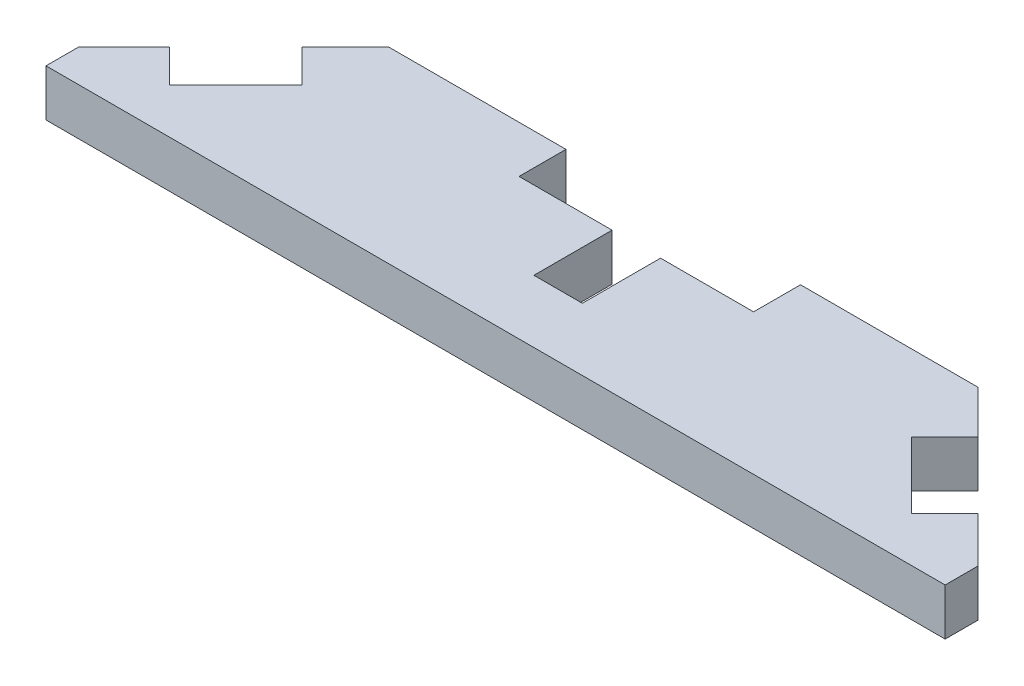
from build123d import *

# Parameters (mm, degrees)
BOSS_EXTRUDE1_DEPTH = 3
SKETCH2_W           = 15
SKETCH2_H           = 3
CUT_EXTRUDE1_DEPTH  = 3
SKETCH3_W           = 3.1
SKETCH3_H           = 8
CUT_EXTRUDE2_DEPTH  = 10
SKETCH4_W           = 1.2
SKETCH4_H           = 18.592899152
CUT_EXTRUDE3_DEPTH  = 31.692059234


with BuildPart() as part:
    # Sketch1 → Boss-Extrude1 (new body)
    with BuildSketch(Plane(origin=(0, 0, 0), x_dir=(1, 0, 0), z_dir=(0, 1, 0))):
        Polygon((-18.85, 6), (-29.95, -5.1), (-29.95, -6), (-18.85, -6), (18.85, -6), (29.95, -6), (29.95, -5.1), (18.85, 6), align=None)
    extrude(amount=BOSS_EXTRUDE1_DEPTH)

    # Sketch2 → Cut-Extrude1 (cut)
    with BuildSketch(Plane(origin=(0, 0, 0), x_dir=(1, 0, 0), z_dir=(0, 1, 0))):
        Polygon((-25.850357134, -1.000357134), (-21.607716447, 3.242283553), (-19.486396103, 1.12096321), (-23.72903679, -3.121677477), align=None)
        Polygon((23.72903679, -3.121677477), (19.486396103, 1.12096321), (21.607716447, 3.242283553), (25.850357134, -1.000357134), align=None)
        with Locations((0, 4.5)):
            Rectangle(SKETCH2_W, SKETCH2_H)
    extrude(amount=CUT_EXTRUDE1_DEPTH, mode=Mode.SUBTRACT)

    # Sketch3 → Cut-Extrude2 (cut)
    with BuildSketch(Plane(origin=(0, 0, 0), x_dir=(1, 0, 0), z_dir=(0, 1, 0))):
        with Locations((0, 2)):
            Rectangle(SKETCH3_W, SKETCH3_H)
    extrude(amount=CUT_EXTRUDE2_DEPTH, mode=Mode.SUBTRACT)

    # Sketch4 → Cut-Extrude3 (cut, through all)
    with BuildSketch(Plane(origin=(0, 0, 0), x_dir=(1, 0, 0), z_dir=(0, 1, 0))):
        with Locations((-29.35, 3.296449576)):
            Rectangle(SKETCH4_W, SKETCH4_H)
        with Locations((29.35, 3.296449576)):
            Rectangle(SKETCH4_W, SKETCH4_H)
    extrude(amount=CUT_EXTRUDE3_DEPTH, mode=Mode.SUBTRACT)


solid = part.part
